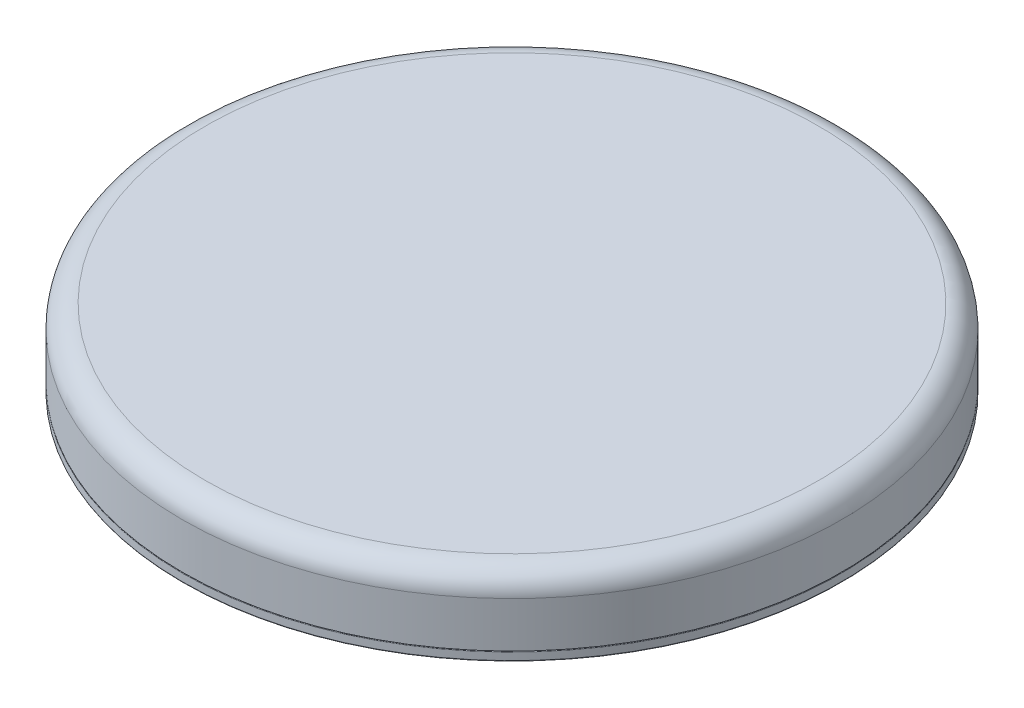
from build123d import *

# Parameters (mm, degrees)
CROQUIS1_R              = 72.5
SALIENTE_EXTRUIR1_DEPTH = 2
REDONDEO1_R             = 0.2
CROQUIS2_R              = 11
CROQUIS2_R_2            = 7.5
SALIENTE_EXTRUIR2_DEPTH = 4
REDONDEO2_R             = 0.2
CROQUIS3_R              = 72.5
SALIENTE_EXTRUIR3_DEPTH = 15
REDONDEO3_R             = 5


with BuildPart() as part:
    # Croquis1 → Saliente-Extruir1 (new body)
    with BuildSketch(Plane(origin=(0, 0, 0), x_dir=(1, 0, 0), z_dir=(0, 1, 0))):
        with Locations(Location((0, 0, 0), (0, 0, 270))):
            Circle(CROQUIS1_R)
    extrude(amount=SALIENTE_EXTRUIR1_DEPTH)

    # Redondeo1
    redondeo1_edges = [part.edges().sort_by_distance(p)[0] for p in [
        (0, 0, -72.5),
        (0, 2, -72.5),
    ]]
    fillet(redondeo1_edges, radius=REDONDEO1_R)

    # Croquis2 → Saliente-Extruir2 (add)
    with BuildSketch(Plane.XZ):
        with Locations(Location((0, 0, 0), (0, 0, 90))):
            Circle(CROQUIS2_R)
        with Locations(Location((0, 0, 0), (0, 0, 270))):
            Circle(CROQUIS2_R_2, mode=Mode.SUBTRACT)
    extrude(amount=SALIENTE_EXTRUIR2_DEPTH)

    # Redondeo2
    redondeo2_edges = [part.edges().sort_by_distance(p)[0] for p in [
        (0, 0, -11),
        (0, -4, 7.5),
        (0, -4, -11),
    ]]
    fillet(redondeo2_edges, radius=REDONDEO2_R)


with BuildPart() as body_2:
    # Croquis3 → Saliente-Extruir3 (new body)
    with BuildSketch(Plane(origin=(0, 2, 0), x_dir=(1, 0, 0), z_dir=(0, 1, 0))):
        with Locations(Location((0, 0, 0), (0, 0, 270))):
            Circle(CROQUIS3_R)
    extrude(amount=SALIENTE_EXTRUIR3_DEPTH)

    # Redondeo3
    redondeo3_edges = [body_2.edges().sort_by_distance(p)[0] for p in [
        (0, 17, -72.5),
    ]]
    fillet(redondeo3_edges, radius=REDONDEO3_R)


solid = Compound([part.part, body_2.part])
